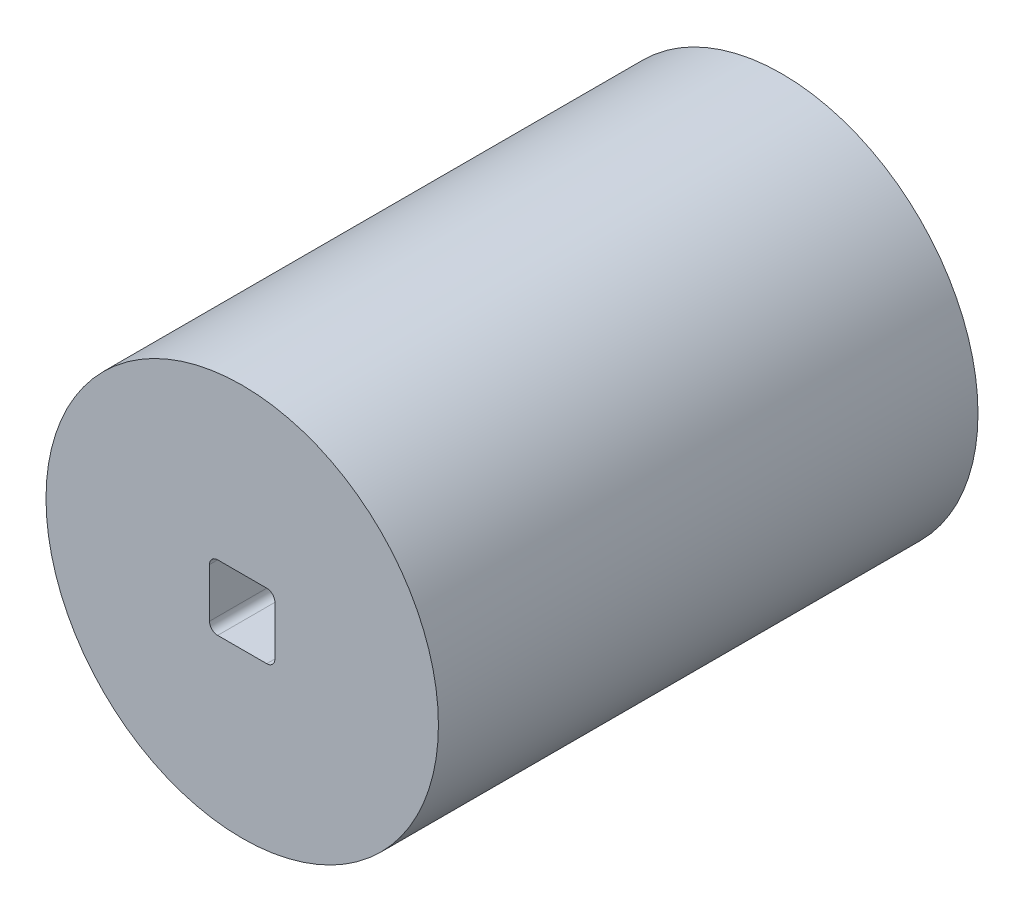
ISO-10303-21;
HEADER;
FILE_DESCRIPTION(('STEP AP214'),'2;1');
FILE_NAME('part.step','',(''),(''),'','','');
FILE_SCHEMA(('AUTOMOTIVE_DESIGN { 1 0 10303 214 1 1 1 1 }'));
ENDSEC;
DATA;
#1=APPLICATION_CONTEXT('core data for automotive mechanical design processes');
#2=APPLICATION_PROTOCOL_DEFINITION('international standard','automotive_design',2000,#1);
#3=PRODUCT_CONTEXT('',#1,'mechanical');
#4=PRODUCT('Part','Part','',(#3));
#5=PRODUCT_RELATED_PRODUCT_CATEGORY('part','',(#4));
#6=PRODUCT_DEFINITION_FORMATION('','',#4);
#7=PRODUCT_DEFINITION_CONTEXT('part definition',#1,'design');
#8=PRODUCT_DEFINITION('design','',#6,#7);
#9=PRODUCT_DEFINITION_SHAPE('','',#8);
#10=(LENGTH_UNIT() NAMED_UNIT(*) SI_UNIT(.MILLI.,.METRE.));
#11=(NAMED_UNIT(*) PLANE_ANGLE_UNIT() SI_UNIT($,.RADIAN.));
#12=(NAMED_UNIT(*) SI_UNIT($,.STERADIAN.) SOLID_ANGLE_UNIT());
#13=UNCERTAINTY_MEASURE_WITH_UNIT(LENGTH_MEASURE(1.E-05),#10,'distance_accuracy_value','');
#14=(GEOMETRIC_REPRESENTATION_CONTEXT(3) GLOBAL_UNCERTAINTY_ASSIGNED_CONTEXT((#13)) GLOBAL_UNIT_ASSIGNED_CONTEXT((#10,
#11,#12)) REPRESENTATION_CONTEXT('',''));
#15=CARTESIAN_POINT('',(0.,0.,0.));
#16=DIRECTION('',(0.,0.,1.));
#17=DIRECTION('',(1.,0.,0.));
#18=AXIS2_PLACEMENT_3D('',#15,#16,#17);
#19=CARTESIAN_POINT('',(0.,0.,-1676.4));
#20=DIRECTION('',(0.,0.,1.));
#21=DIRECTION('',(1.,0.,0.));
#22=AXIS2_PLACEMENT_3D('',#19,#20,#21);
#23=CYLINDRICAL_SURFACE('',#22,609.6);
#24=CARTESIAN_POINT('',(0.,0.,-1676.4));
#25=DIRECTION('',(0.,0.,1.));
#26=DIRECTION('',(1.,0.,0.));
#27=AXIS2_PLACEMENT_3D('',#24,#25,#26);
#28=CIRCLE('',#27,609.6);
#29=CARTESIAN_POINT('',(609.6,0.,-1676.4));
#30=VERTEX_POINT('',#29);
#31=EDGE_CURVE('E53',#30,#30,#28,.T.);
#32=ORIENTED_EDGE('',*,*,#31,.T.);
#33=EDGE_LOOP('',(#32));
#34=FACE_BOUND('',#33,.T.);
#35=CARTESIAN_POINT('',(0.,0.,0.));
#36=DIRECTION('',(0.,0.,1.));
#37=DIRECTION('',(1.,0.,0.));
#38=AXIS2_PLACEMENT_3D('',#35,#36,#37);
#39=CIRCLE('',#38,609.6);
#40=CARTESIAN_POINT('',(609.6,0.,0.));
#41=VERTEX_POINT('',#40);
#42=EDGE_CURVE('E238',#41,#41,#39,.T.);
#43=ORIENTED_EDGE('',*,*,#42,.F.);
#44=EDGE_LOOP('',(#43));
#45=FACE_BOUND('',#44,.T.);
#46=ADVANCED_FACE('F45',(#34,#45),#23,.T.);
#47=CARTESIAN_POINT('',(0.,0.,-1676.4));
#48=DIRECTION('',(0.,0.,1.));
#49=DIRECTION('',(1.,0.,0.));
#50=AXIS2_PLACEMENT_3D('',#47,#48,#49);
#51=PLANE('',#50);
#52=ORIENTED_EDGE('',*,*,#31,.F.);
#53=EDGE_LOOP('',(#52));
#54=FACE_BOUND('',#53,.T.);
#55=ADVANCED_FACE('F268',(#54),#51,.F.);
#56=CARTESIAN_POINT('',(0.,0.,0.));
#57=DIRECTION('',(0.,0.,1.));
#58=DIRECTION('',(1.,0.,0.));
#59=AXIS2_PLACEMENT_3D('',#56,#57,#58);
#60=PLANE('',#59);
#61=DIRECTION('',(0.,-1.,0.));
#62=VECTOR('',#61,1.);
#63=CARTESIAN_POINT('',(-101.6,0.,0.));
#64=LINE('',#63,#62);
#65=CARTESIAN_POINT('',(-101.6,76.2,0.));
#66=VERTEX_POINT('',#65);
#67=CARTESIAN_POINT('',(-101.6,-76.2,0.));
#68=VERTEX_POINT('',#67);
#69=EDGE_CURVE('E205',#66,#68,#64,.T.);
#70=ORIENTED_EDGE('',*,*,#69,.F.);
#71=CARTESIAN_POINT('',(-76.2,76.2,0.));
#72=DIRECTION('',(0.,0.,1.));
#73=DIRECTION('',(1.,0.,0.));
#74=AXIS2_PLACEMENT_3D('',#71,#72,#73);
#75=CIRCLE('',#74,25.4);
#76=CARTESIAN_POINT('',(-76.2,101.6,0.));
#77=VERTEX_POINT('',#76);
#78=EDGE_CURVE('E231',#77,#66,#75,.T.);
#79=ORIENTED_EDGE('',*,*,#78,.F.);
#80=DIRECTION('',(1.,0.,0.));
#81=VECTOR('',#80,1.);
#82=CARTESIAN_POINT('',(0.,101.6,0.));
#83=LINE('',#82,#81);
#84=CARTESIAN_POINT('',(76.2,101.6,0.));
#85=VERTEX_POINT('',#84);
#86=EDGE_CURVE('E227',#77,#85,#83,.T.);
#87=ORIENTED_EDGE('',*,*,#86,.T.);
#88=CARTESIAN_POINT('',(76.2,76.2,0.));
#89=DIRECTION('',(0.,0.,1.));
#90=DIRECTION('',(1.,0.,0.));
#91=AXIS2_PLACEMENT_3D('',#88,#89,#90);
#92=CIRCLE('',#91,25.4);
#93=CARTESIAN_POINT('',(101.6,76.2,0.));
#94=VERTEX_POINT('',#93);
#95=EDGE_CURVE('E223',#94,#85,#92,.T.);
#96=ORIENTED_EDGE('',*,*,#95,.F.);
#97=DIRECTION('',(0.,1.,0.));
#98=VECTOR('',#97,1.);
#99=CARTESIAN_POINT('',(101.6,0.,0.));
#100=LINE('',#99,#98);
#101=CARTESIAN_POINT('',(101.6,-76.2,0.));
#102=VERTEX_POINT('',#101);
#103=EDGE_CURVE('E219',#102,#94,#100,.T.);
#104=ORIENTED_EDGE('',*,*,#103,.F.);
#105=CARTESIAN_POINT('',(76.2,-76.2,0.));
#106=DIRECTION('',(0.,0.,1.));
#107=DIRECTION('',(1.,0.,0.));
#108=AXIS2_PLACEMENT_3D('',#105,#106,#107);
#109=CIRCLE('',#108,25.4);
#110=CARTESIAN_POINT('',(76.2,-101.6,0.));
#111=VERTEX_POINT('',#110);
#112=EDGE_CURVE('E215',#111,#102,#109,.T.);
#113=ORIENTED_EDGE('',*,*,#112,.F.);
#114=DIRECTION('',(-1.,0.,0.));
#115=VECTOR('',#114,1.);
#116=CARTESIAN_POINT('',(0.,-101.6,0.));
#117=LINE('',#116,#115);
#118=CARTESIAN_POINT('',(-76.2,-101.6,0.));
#119=VERTEX_POINT('',#118);
#120=EDGE_CURVE('E211',#111,#119,#117,.T.);
#121=ORIENTED_EDGE('',*,*,#120,.T.);
#122=CARTESIAN_POINT('',(-76.2,-76.2,0.));
#123=DIRECTION('',(0.,0.,1.));
#124=DIRECTION('',(1.,0.,0.));
#125=AXIS2_PLACEMENT_3D('',#122,#123,#124);
#126=CIRCLE('',#125,25.4);
#127=EDGE_CURVE('E208',#68,#119,#126,.T.);
#128=ORIENTED_EDGE('',*,*,#127,.F.);
#129=EDGE_LOOP('',(#70,#79,#87,#96,#104,#113,#121,#128));
#130=FACE_BOUND('',#129,.T.);
#131=ORIENTED_EDGE('',*,*,#42,.T.);
#132=EDGE_LOOP('',(#131));
#133=FACE_BOUND('',#132,.T.);
#134=ADVANCED_FACE('F265',(#130,#133),#60,.T.);
#135=CARTESIAN_POINT('',(-101.6,0.,-1625.6));
#136=DIRECTION('',(-1.,0.,0.));
#137=DIRECTION('',(0.,-1.,0.));
#138=AXIS2_PLACEMENT_3D('',#135,#136,#137);
#139=PLANE('',#138);
#140=DIRECTION('',(0.,0.,1.));
#141=VECTOR('',#140,1.);
#142=CARTESIAN_POINT('',(-101.6,-76.2,-1625.6));
#143=LINE('',#142,#141);
#144=CARTESIAN_POINT('',(-101.6,-76.2,-1616.075));
#145=VERTEX_POINT('',#144);
#146=EDGE_CURVE('E66',#145,#68,#143,.T.);
#147=ORIENTED_EDGE('',*,*,#146,.F.);
#148=DIRECTION('',(0.,1.,0.));
#149=VECTOR('',#148,1.);
#150=CARTESIAN_POINT('',(-101.6,0.,-1616.075));
#151=LINE('',#150,#149);
#152=CARTESIAN_POINT('',(-101.6,76.2,-1616.075));
#153=VERTEX_POINT('',#152);
#154=EDGE_CURVE('E60',#145,#153,#151,.T.);
#155=ORIENTED_EDGE('',*,*,#154,.T.);
#156=DIRECTION('',(0.,0.,1.));
#157=VECTOR('',#156,1.);
#158=CARTESIAN_POINT('',(-101.6,76.2,-1625.6));
#159=LINE('',#158,#157);
#160=EDGE_CURVE('E235',#153,#66,#159,.T.);
#161=ORIENTED_EDGE('',*,*,#160,.T.);
#162=ORIENTED_EDGE('',*,*,#69,.T.);
#163=EDGE_LOOP('',(#147,#155,#161,#162));
#164=FACE_BOUND('',#163,.T.);
#165=ADVANCED_FACE('F279',(#164),#139,.F.);
#166=CARTESIAN_POINT('',(-76.2,76.2,-1625.6));
#167=DIRECTION('',(0.,0.,1.));
#168=DIRECTION('',(1.,0.,0.));
#169=AXIS2_PLACEMENT_3D('',#166,#167,#168);
#170=CYLINDRICAL_SURFACE('',#169,25.4);
#171=ORIENTED_EDGE('',*,*,#160,.F.);
#172=CARTESIAN_POINT('',(-76.2,76.2,-1616.075));
#173=DIRECTION('',(0.,0.,1.));
#174=DIRECTION('',(1.,0.,0.));
#175=AXIS2_PLACEMENT_3D('',#172,#173,#174);
#176=CIRCLE('',#175,25.4);
#177=CARTESIAN_POINT('',(-76.2,101.6,-1616.075));
#178=VERTEX_POINT('',#177);
#179=EDGE_CURVE('E199',#153,#178,#176,.F.);
#180=ORIENTED_EDGE('',*,*,#179,.T.);
#181=DIRECTION('',(0.,0.,1.));
#182=VECTOR('',#181,1.);
#183=CARTESIAN_POINT('',(-76.2,101.6,-1625.6));
#184=LINE('',#183,#182);
#185=EDGE_CURVE('E239',#178,#77,#184,.T.);
#186=ORIENTED_EDGE('',*,*,#185,.T.);
#187=ORIENTED_EDGE('',*,*,#78,.T.);
#188=EDGE_LOOP('',(#171,#180,#186,#187));
#189=FACE_BOUND('',#188,.T.);
#190=ADVANCED_FACE('F284',(#189),#170,.F.);
#191=CARTESIAN_POINT('',(0.,101.6,-1625.6));
#192=DIRECTION('',(0.,-1.,0.));
#193=DIRECTION('',(0.,0.,-1.));
#194=AXIS2_PLACEMENT_3D('',#191,#192,#193);
#195=PLANE('',#194);
#196=DIRECTION('',(-1.,0.,0.));
#197=VECTOR('',#196,1.);
#198=CARTESIAN_POINT('',(0.,101.6,-1616.075));
#199=LINE('',#198,#197);
#200=CARTESIAN_POINT('',(76.2,101.6,-1616.075));
#201=VERTEX_POINT('',#200);
#202=EDGE_CURVE('E196',#201,#178,#199,.T.);
#203=ORIENTED_EDGE('',*,*,#202,.F.);
#204=DIRECTION('',(0.,0.,1.));
#205=VECTOR('',#204,1.);
#206=CARTESIAN_POINT('',(76.2,101.6,-1625.6));
#207=LINE('',#206,#205);
#208=EDGE_CURVE('E242',#201,#85,#207,.T.);
#209=ORIENTED_EDGE('',*,*,#208,.T.);
#210=ORIENTED_EDGE('',*,*,#86,.F.);
#211=ORIENTED_EDGE('',*,*,#185,.F.);
#212=EDGE_LOOP('',(#203,#209,#210,#211));
#213=FACE_BOUND('',#212,.T.);
#214=ADVANCED_FACE('F304',(#213),#195,.T.);
#215=CARTESIAN_POINT('',(76.2,76.2,-1625.6));
#216=DIRECTION('',(0.,0.,1.));
#217=DIRECTION('',(1.,0.,0.));
#218=AXIS2_PLACEMENT_3D('',#215,#216,#217);
#219=CYLINDRICAL_SURFACE('',#218,25.4);
#220=ORIENTED_EDGE('',*,*,#208,.F.);
#221=CARTESIAN_POINT('',(76.2,76.2,-1616.075));
#222=DIRECTION('',(0.,0.,1.));
#223=DIRECTION('',(1.,0.,0.));
#224=AXIS2_PLACEMENT_3D('',#221,#222,#223);
#225=CIRCLE('',#224,25.4);
#226=CARTESIAN_POINT('',(101.6,76.2,-1616.075));
#227=VERTEX_POINT('',#226);
#228=EDGE_CURVE('E192',#201,#227,#225,.F.);
#229=ORIENTED_EDGE('',*,*,#228,.T.);
#230=DIRECTION('',(0.,0.,1.));
#231=VECTOR('',#230,1.);
#232=CARTESIAN_POINT('',(101.6,76.2,-1625.6));
#233=LINE('',#232,#231);
#234=EDGE_CURVE('E245',#227,#94,#233,.T.);
#235=ORIENTED_EDGE('',*,*,#234,.T.);
#236=ORIENTED_EDGE('',*,*,#95,.T.);
#237=EDGE_LOOP('',(#220,#229,#235,#236));
#238=FACE_BOUND('',#237,.T.);
#239=ADVANCED_FACE('F300',(#238),#219,.F.);
#240=CARTESIAN_POINT('',(101.6,0.,-1625.6));
#241=DIRECTION('',(1.,0.,0.));
#242=DIRECTION('',(0.,0.,-1.));
#243=AXIS2_PLACEMENT_3D('',#240,#241,#242);
#244=PLANE('',#243);
#245=ORIENTED_EDGE('',*,*,#234,.F.);
#246=DIRECTION('',(0.,-1.,0.));
#247=VECTOR('',#246,1.);
#248=CARTESIAN_POINT('',(101.6,0.,-1616.075));
#249=LINE('',#248,#247);
#250=CARTESIAN_POINT('',(101.6,-76.2,-1616.075));
#251=VERTEX_POINT('',#250);
#252=EDGE_CURVE('E188',#227,#251,#249,.T.);
#253=ORIENTED_EDGE('',*,*,#252,.T.);
#254=DIRECTION('',(0.,0.,1.));
#255=VECTOR('',#254,1.);
#256=CARTESIAN_POINT('',(101.6,-76.2,-1625.6));
#257=LINE('',#256,#255);
#258=EDGE_CURVE('E248',#251,#102,#257,.T.);
#259=ORIENTED_EDGE('',*,*,#258,.T.);
#260=ORIENTED_EDGE('',*,*,#103,.T.);
#261=EDGE_LOOP('',(#245,#253,#259,#260));
#262=FACE_BOUND('',#261,.T.);
#263=ADVANCED_FACE('F296',(#262),#244,.F.);
#264=CARTESIAN_POINT('',(76.2,-76.2,-1625.6));
#265=DIRECTION('',(0.,0.,1.));
#266=DIRECTION('',(1.,0.,0.));
#267=AXIS2_PLACEMENT_3D('',#264,#265,#266);
#268=CYLINDRICAL_SURFACE('',#267,25.4);
#269=ORIENTED_EDGE('',*,*,#258,.F.);
#270=CARTESIAN_POINT('',(76.2,-76.2,-1616.075));
#271=DIRECTION('',(0.,0.,1.));
#272=DIRECTION('',(1.,0.,0.));
#273=AXIS2_PLACEMENT_3D('',#270,#271,#272);
#274=CIRCLE('',#273,25.4);
#275=CARTESIAN_POINT('',(76.2,-101.6,-1616.075));
#276=VERTEX_POINT('',#275);
#277=EDGE_CURVE('E179',#251,#276,#274,.F.);
#278=ORIENTED_EDGE('',*,*,#277,.T.);
#279=DIRECTION('',(0.,0.,1.));
#280=VECTOR('',#279,1.);
#281=CARTESIAN_POINT('',(76.2,-101.6,-1625.6));
#282=LINE('',#281,#280);
#283=EDGE_CURVE('E251',#276,#111,#282,.T.);
#284=ORIENTED_EDGE('',*,*,#283,.T.);
#285=ORIENTED_EDGE('',*,*,#112,.T.);
#286=EDGE_LOOP('',(#269,#278,#284,#285));
#287=FACE_BOUND('',#286,.T.);
#288=ADVANCED_FACE('F292',(#287),#268,.F.);
#289=CARTESIAN_POINT('',(0.,-101.6,-1625.6));
#290=DIRECTION('',(0.,1.,0.));
#291=DIRECTION('',(0.,0.,1.));
#292=AXIS2_PLACEMENT_3D('',#289,#290,#291);
#293=PLANE('',#292);
#294=DIRECTION('',(1.,0.,0.));
#295=VECTOR('',#294,1.);
#296=CARTESIAN_POINT('',(0.,-101.6,-1616.075));
#297=LINE('',#296,#295);
#298=CARTESIAN_POINT('',(-76.2,-101.6,-1616.075));
#299=VERTEX_POINT('',#298);
#300=EDGE_CURVE('E174',#299,#276,#297,.T.);
#301=ORIENTED_EDGE('',*,*,#300,.F.);
#302=DIRECTION('',(0.,0.,1.));
#303=VECTOR('',#302,1.);
#304=CARTESIAN_POINT('',(-76.2,-101.6,-1625.6));
#305=LINE('',#304,#303);
#306=EDGE_CURVE('E254',#299,#119,#305,.T.);
#307=ORIENTED_EDGE('',*,*,#306,.T.);
#308=ORIENTED_EDGE('',*,*,#120,.F.);
#309=ORIENTED_EDGE('',*,*,#283,.F.);
#310=EDGE_LOOP('',(#301,#307,#308,#309));
#311=FACE_BOUND('',#310,.T.);
#312=ADVANCED_FACE('F289',(#311),#293,.T.);
#313=CARTESIAN_POINT('',(-76.2,-76.2,-1625.6));
#314=DIRECTION('',(0.,0.,1.));
#315=DIRECTION('',(1.,0.,0.));
#316=AXIS2_PLACEMENT_3D('',#313,#314,#315);
#317=CYLINDRICAL_SURFACE('',#316,25.4);
#318=ORIENTED_EDGE('',*,*,#306,.F.);
#319=CARTESIAN_POINT('',(-76.2,-76.2,-1616.075));
#320=DIRECTION('',(0.,0.,1.));
#321=DIRECTION('',(1.,0.,0.));
#322=AXIS2_PLACEMENT_3D('',#319,#320,#321);
#323=CIRCLE('',#322,25.4);
#324=EDGE_CURVE('E11',#299,#145,#323,.F.);
#325=ORIENTED_EDGE('',*,*,#324,.T.);
#326=ORIENTED_EDGE('',*,*,#146,.T.);
#327=ORIENTED_EDGE('',*,*,#127,.T.);
#328=EDGE_LOOP('',(#318,#325,#326,#327));
#329=FACE_BOUND('',#328,.T.);
#330=ADVANCED_FACE('F286',(#329),#317,.F.);
#331=CARTESIAN_POINT('',(0.,0.,-1616.075));
#332=DIRECTION('',(0.,0.,1.));
#333=DIRECTION('',(1.,0.,0.));
#334=AXIS2_PLACEMENT_3D('',#331,#332,#333);
#335=PLANE('',#334);
#336=ORIENTED_EDGE('',*,*,#324,.F.);
#337=ORIENTED_EDGE('',*,*,#300,.T.);
#338=ORIENTED_EDGE('',*,*,#277,.F.);
#339=ORIENTED_EDGE('',*,*,#252,.F.);
#340=ORIENTED_EDGE('',*,*,#228,.F.);
#341=ORIENTED_EDGE('',*,*,#202,.T.);
#342=ORIENTED_EDGE('',*,*,#179,.F.);
#343=ORIENTED_EDGE('',*,*,#154,.F.);
#344=EDGE_LOOP('',(#336,#337,#338,#339,#340,#341,#342,#343));
#345=FACE_BOUND('',#344,.T.);
#346=DIRECTION('',(0.,1.,0.));
#347=VECTOR('',#346,1.);
#348=CARTESIAN_POINT('',(457.2,-263.964543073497,-1616.075));
#349=LINE('',#348,#347);
#350=CARTESIAN_POINT('',(457.2,-263.964543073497,-1616.075));
#351=VERTEX_POINT('',#350);
#352=CARTESIAN_POINT('',(457.2,263.964543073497,-1616.075));
#353=VERTEX_POINT('',#352);
#354=EDGE_CURVE('E150',#351,#353,#349,.T.);
#355=ORIENTED_EDGE('',*,*,#354,.F.);
#356=DIRECTION('',(0.866025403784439,0.5,0.));
#357=VECTOR('',#356,1.);
#358=CARTESIAN_POINT('',(0.,-527.929086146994,-1616.075));
#359=LINE('',#358,#357);
#360=CARTESIAN_POINT('',(0.,-527.929086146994,-1616.075));
#361=VERTEX_POINT('',#360);
#362=EDGE_CURVE('E353',#361,#351,#359,.T.);
#363=ORIENTED_EDGE('',*,*,#362,.F.);
#364=DIRECTION('',(0.866025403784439,-0.5,0.));
#365=VECTOR('',#364,1.);
#366=CARTESIAN_POINT('',(-457.2,-263.964543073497,-1616.075));
#367=LINE('',#366,#365);
#368=CARTESIAN_POINT('',(-457.2,-263.964543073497,-1616.075));
#369=VERTEX_POINT('',#368);
#370=EDGE_CURVE('E378',#369,#361,#367,.T.);
#371=ORIENTED_EDGE('',*,*,#370,.F.);
#372=DIRECTION('',(0.,-1.,0.));
#373=VECTOR('',#372,1.);
#374=CARTESIAN_POINT('',(-457.2,263.964543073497,-1616.075));
#375=LINE('',#374,#373);
#376=CARTESIAN_POINT('',(-457.2,263.964543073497,-1616.075));
#377=VERTEX_POINT('',#376);
#378=EDGE_CURVE('E381',#377,#369,#375,.T.);
#379=ORIENTED_EDGE('',*,*,#378,.F.);
#380=DIRECTION('',(-0.866025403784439,-0.5,0.));
#381=VECTOR('',#380,1.);
#382=CARTESIAN_POINT('',(0.,527.929086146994,-1616.075));
#383=LINE('',#382,#381);
#384=CARTESIAN_POINT('',(0.,527.929086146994,-1616.075));
#385=VERTEX_POINT('',#384);
#386=EDGE_CURVE('E152',#385,#377,#383,.T.);
#387=ORIENTED_EDGE('',*,*,#386,.F.);
#388=DIRECTION('',(-0.866025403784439,0.5,0.));
#389=VECTOR('',#388,1.);
#390=CARTESIAN_POINT('',(457.2,263.964543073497,-1616.075));
#391=LINE('',#390,#389);
#392=EDGE_CURVE('E146',#353,#385,#391,.T.);
#393=ORIENTED_EDGE('',*,*,#392,.F.);
#394=EDGE_LOOP('',(#355,#363,#371,#379,#387,#393));
#395=FACE_BOUND('',#394,.T.);
#396=ADVANCED_FACE('F148',(#345,#395),#335,.F.);
#397=CARTESIAN_POINT('',(457.2,-263.964543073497,-1616.075));
#398=DIRECTION('',(-1.,0.,0.));
#399=DIRECTION('',(0.,-1.,0.));
#400=AXIS2_PLACEMENT_3D('',#397,#398,#399);
#401=PLANE('',#400);
#402=DIRECTION('',(0.,1.,0.));
#403=VECTOR('',#402,1.);
#404=CARTESIAN_POINT('',(457.2,-263.964543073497,-1635.125));
#405=LINE('',#404,#403);
#406=CARTESIAN_POINT('',(457.2,-263.964543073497,-1635.125));
#407=VERTEX_POINT('',#406);
#408=CARTESIAN_POINT('',(457.2,263.964543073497,-1635.125));
#409=VERTEX_POINT('',#408);
#410=EDGE_CURVE('E373',#407,#409,#405,.T.);
#411=ORIENTED_EDGE('',*,*,#410,.F.);
#412=DIRECTION('',(0.,0.,-1.));
#413=VECTOR('',#412,1.);
#414=CARTESIAN_POINT('',(457.2,-263.964543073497,-1616.075));
#415=LINE('',#414,#413);
#416=EDGE_CURVE('E167',#351,#407,#415,.T.);
#417=ORIENTED_EDGE('',*,*,#416,.F.);
#418=ORIENTED_EDGE('',*,*,#354,.T.);
#419=DIRECTION('',(0.,0.,-1.));
#420=VECTOR('',#419,1.);
#421=CARTESIAN_POINT('',(457.2,263.964543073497,-1616.075));
#422=LINE('',#421,#420);
#423=EDGE_CURVE('E164',#353,#409,#422,.T.);
#424=ORIENTED_EDGE('',*,*,#423,.T.);
#425=EDGE_LOOP('',(#411,#417,#418,#424));
#426=FACE_BOUND('',#425,.T.);
#427=ADVANCED_FACE('F163',(#426),#401,.T.);
#428=CARTESIAN_POINT('',(457.2,263.964543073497,-1616.075));
#429=DIRECTION('',(-0.5,-0.866025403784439,0.));
#430=DIRECTION('',(0.866025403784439,-0.5,0.));
#431=AXIS2_PLACEMENT_3D('',#428,#429,#430);
#432=PLANE('',#431);
#433=DIRECTION('',(-0.866025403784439,0.5,0.));
#434=VECTOR('',#433,1.);
#435=CARTESIAN_POINT('',(457.2,263.964543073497,-1635.125));
#436=LINE('',#435,#434);
#437=CARTESIAN_POINT('',(0.,527.929086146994,-1635.125));
#438=VERTEX_POINT('',#437);
#439=EDGE_CURVE('E172',#409,#438,#436,.T.);
#440=ORIENTED_EDGE('',*,*,#439,.F.);
#441=ORIENTED_EDGE('',*,*,#423,.F.);
#442=ORIENTED_EDGE('',*,*,#392,.T.);
#443=DIRECTION('',(0.,0.,-1.));
#444=VECTOR('',#443,1.);
#445=CARTESIAN_POINT('',(0.,527.929086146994,-1616.075));
#446=LINE('',#445,#444);
#447=EDGE_CURVE('E175',#385,#438,#446,.T.);
#448=ORIENTED_EDGE('',*,*,#447,.T.);
#449=EDGE_LOOP('',(#440,#441,#442,#448));
#450=FACE_BOUND('',#449,.T.);
#451=ADVANCED_FACE('F171',(#450),#432,.T.);
#452=CARTESIAN_POINT('',(0.,527.929086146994,-1616.075));
#453=DIRECTION('',(0.5,-0.866025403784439,0.));
#454=DIRECTION('',(0.866025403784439,0.5,0.));
#455=AXIS2_PLACEMENT_3D('',#452,#453,#454);
#456=PLANE('',#455);
#457=DIRECTION('',(-0.866025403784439,-0.5,0.));
#458=VECTOR('',#457,1.);
#459=CARTESIAN_POINT('',(0.,527.929086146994,-1635.125));
#460=LINE('',#459,#458);
#461=CARTESIAN_POINT('',(-457.2,263.964543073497,-1635.125));
#462=VERTEX_POINT('',#461);
#463=EDGE_CURVE('E364',#438,#462,#460,.T.);
#464=ORIENTED_EDGE('',*,*,#463,.F.);
#465=ORIENTED_EDGE('',*,*,#447,.F.);
#466=ORIENTED_EDGE('',*,*,#386,.T.);
#467=DIRECTION('',(0.,0.,-1.));
#468=VECTOR('',#467,1.);
#469=CARTESIAN_POINT('',(-457.2,263.964543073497,-1616.075));
#470=LINE('',#469,#468);
#471=EDGE_CURVE('E181',#377,#462,#470,.T.);
#472=ORIENTED_EDGE('',*,*,#471,.T.);
#473=EDGE_LOOP('',(#464,#465,#466,#472));
#474=FACE_BOUND('',#473,.T.);
#475=ADVANCED_FACE('F323',(#474),#456,.T.);
#476=CARTESIAN_POINT('',(-457.2,263.964543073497,-1616.075));
#477=DIRECTION('',(1.,0.,0.));
#478=DIRECTION('',(0.,0.,-1.));
#479=AXIS2_PLACEMENT_3D('',#476,#477,#478);
#480=PLANE('',#479);
#481=DIRECTION('',(0.,-1.,0.));
#482=VECTOR('',#481,1.);
#483=CARTESIAN_POINT('',(-457.2,263.964543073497,-1635.125));
#484=LINE('',#483,#482);
#485=CARTESIAN_POINT('',(-457.2,-263.964543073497,-1635.125));
#486=VERTEX_POINT('',#485);
#487=EDGE_CURVE('E347',#462,#486,#484,.T.);
#488=ORIENTED_EDGE('',*,*,#487,.F.);
#489=ORIENTED_EDGE('',*,*,#471,.F.);
#490=ORIENTED_EDGE('',*,*,#378,.T.);
#491=DIRECTION('',(0.,0.,-1.));
#492=VECTOR('',#491,1.);
#493=CARTESIAN_POINT('',(-457.2,-263.964543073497,-1616.075));
#494=LINE('',#493,#492);
#495=EDGE_CURVE('E356',#369,#486,#494,.T.);
#496=ORIENTED_EDGE('',*,*,#495,.T.);
#497=EDGE_LOOP('',(#488,#489,#490,#496));
#498=FACE_BOUND('',#497,.T.);
#499=ADVANCED_FACE('F326',(#498),#480,.T.);
#500=CARTESIAN_POINT('',(-457.2,-263.964543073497,-1616.075));
#501=DIRECTION('',(0.5,0.866025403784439,0.));
#502=DIRECTION('',(-0.866025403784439,0.5,0.));
#503=AXIS2_PLACEMENT_3D('',#500,#501,#502);
#504=PLANE('',#503);
#505=DIRECTION('',(0.866025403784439,-0.5,0.));
#506=VECTOR('',#505,1.);
#507=CARTESIAN_POINT('',(-457.2,-263.964543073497,-1635.125));
#508=LINE('',#507,#506);
#509=CARTESIAN_POINT('',(0.,-527.929086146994,-1635.125));
#510=VERTEX_POINT('',#509);
#511=EDGE_CURVE('E344',#486,#510,#508,.T.);
#512=ORIENTED_EDGE('',*,*,#511,.F.);
#513=ORIENTED_EDGE('',*,*,#495,.F.);
#514=ORIENTED_EDGE('',*,*,#370,.T.);
#515=DIRECTION('',(0.,0.,-1.));
#516=VECTOR('',#515,1.);
#517=CARTESIAN_POINT('',(0.,-527.929086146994,-1616.075));
#518=LINE('',#517,#516);
#519=EDGE_CURVE('E342',#361,#510,#518,.T.);
#520=ORIENTED_EDGE('',*,*,#519,.T.);
#521=EDGE_LOOP('',(#512,#513,#514,#520));
#522=FACE_BOUND('',#521,.T.);
#523=ADVANCED_FACE('F330',(#522),#504,.T.);
#524=CARTESIAN_POINT('',(0.,-527.929086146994,-1616.075));
#525=DIRECTION('',(-0.5,0.866025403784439,0.));
#526=DIRECTION('',(-0.866025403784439,-0.5,0.));
#527=AXIS2_PLACEMENT_3D('',#524,#525,#526);
#528=PLANE('',#527);
#529=DIRECTION('',(0.866025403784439,0.5,0.));
#530=VECTOR('',#529,1.);
#531=CARTESIAN_POINT('',(0.,-527.929086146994,-1635.125));
#532=LINE('',#531,#530);
#533=EDGE_CURVE('E169',#510,#407,#532,.T.);
#534=ORIENTED_EDGE('',*,*,#533,.F.);
#535=ORIENTED_EDGE('',*,*,#519,.F.);
#536=ORIENTED_EDGE('',*,*,#362,.T.);
#537=ORIENTED_EDGE('',*,*,#416,.T.);
#538=EDGE_LOOP('',(#534,#535,#536,#537));
#539=FACE_BOUND('',#538,.T.);
#540=ADVANCED_FACE('F315',(#539),#528,.T.);
#541=CARTESIAN_POINT('',(0.,0.,-1635.125));
#542=DIRECTION('',(0.,0.,1.));
#543=DIRECTION('',(1.,0.,0.));
#544=AXIS2_PLACEMENT_3D('',#541,#542,#543);
#545=PLANE('',#544);
#546=ORIENTED_EDGE('',*,*,#410,.T.);
#547=ORIENTED_EDGE('',*,*,#439,.T.);
#548=ORIENTED_EDGE('',*,*,#463,.T.);
#549=ORIENTED_EDGE('',*,*,#487,.T.);
#550=ORIENTED_EDGE('',*,*,#511,.T.);
#551=ORIENTED_EDGE('',*,*,#533,.T.);
#552=EDGE_LOOP('',(#546,#547,#548,#549,#550,#551));
#553=FACE_BOUND('',#552,.T.);
#554=ADVANCED_FACE('F312',(#553),#545,.T.);
#555=CLOSED_SHELL('',(#46,#55,#134,#165,#190,#214,#239,#263,#288,#312,#330,#396,#427,#451,#475,
#499,#523,#540,#554));
#556=MANIFOLD_SOLID_BREP('B2',#555);
#557=ADVANCED_BREP_SHAPE_REPRESENTATION('',(#18,#556),#14);
#558=SHAPE_DEFINITION_REPRESENTATION(#9,#557);
ENDSEC;
END-ISO-10303-21;
